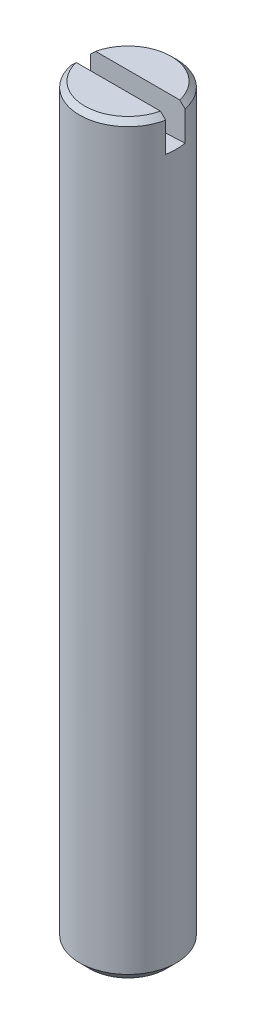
ISO-10303-21;
HEADER;
FILE_DESCRIPTION(('STEP AP214'),'2;1');
FILE_NAME('part.step','',(''),(''),'','','');
FILE_SCHEMA(('AUTOMOTIVE_DESIGN { 1 0 10303 214 1 1 1 1 }'));
ENDSEC;
DATA;
#1=APPLICATION_CONTEXT('core data for automotive mechanical design processes');
#2=APPLICATION_PROTOCOL_DEFINITION('international standard','automotive_design',2000,#1);
#3=PRODUCT_CONTEXT('',#1,'mechanical');
#4=PRODUCT('Part','Part','',(#3));
#5=PRODUCT_RELATED_PRODUCT_CATEGORY('part','',(#4));
#6=PRODUCT_DEFINITION_FORMATION('','',#4);
#7=PRODUCT_DEFINITION_CONTEXT('part definition',#1,'design');
#8=PRODUCT_DEFINITION('design','',#6,#7);
#9=PRODUCT_DEFINITION_SHAPE('','',#8);
#10=(LENGTH_UNIT() NAMED_UNIT(*) SI_UNIT(.MILLI.,.METRE.));
#11=(NAMED_UNIT(*) PLANE_ANGLE_UNIT() SI_UNIT($,.RADIAN.));
#12=(NAMED_UNIT(*) SI_UNIT($,.STERADIAN.) SOLID_ANGLE_UNIT());
#13=UNCERTAINTY_MEASURE_WITH_UNIT(LENGTH_MEASURE(1.E-05),#10,'distance_accuracy_value','');
#14=(GEOMETRIC_REPRESENTATION_CONTEXT(3) GLOBAL_UNCERTAINTY_ASSIGNED_CONTEXT((#13)) GLOBAL_UNIT_ASSIGNED_CONTEXT((#10,
#11,#12)) REPRESENTATION_CONTEXT('',''));
#15=CARTESIAN_POINT('',(0.,0.,0.));
#16=DIRECTION('',(0.,0.,1.));
#17=DIRECTION('',(1.,0.,0.));
#18=AXIS2_PLACEMENT_3D('',#15,#16,#17);
#19=CARTESIAN_POINT('',(0.,61.,0.4));
#20=DIRECTION('',(0.,0.,-1.));
#21=DIRECTION('',(-1.,0.,0.));
#22=AXIS2_PLACEMENT_3D('',#19,#20,#21);
#23=CYLINDRICAL_SURFACE('',#22,31.5);
#24=CARTESIAN_POINT('',(1.95959179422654,29.5610114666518,-0.4));
#25=CARTESIAN_POINT('',(1.97091486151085,29.5617184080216,-0.344561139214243));
#26=CARTESIAN_POINT('',(1.97987306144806,29.562281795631,-0.288637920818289));
#27=CARTESIAN_POINT('',(1.99302430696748,29.5631121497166,-0.1762131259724));
#28=CARTESIAN_POINT('',(1.99721579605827,29.5633790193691,-0.119711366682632));
#29=CARTESIAN_POINT('',(2.0007609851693,29.5636046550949,-0.00749894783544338));
#30=CARTESIAN_POINT('',(2.00019410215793,29.5635684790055,0.0482092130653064));
#31=CARTESIAN_POINT('',(1.99441663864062,29.5632012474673,0.15936012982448));
#32=CARTESIAN_POINT('',(1.98920814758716,29.5628703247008,0.21480299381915));
#33=CARTESIAN_POINT('',(1.97576492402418,29.562023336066,0.313516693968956));
#34=CARTESIAN_POINT('',(1.96839158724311,29.561560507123,0.356906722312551));
#35=CARTESIAN_POINT('',(1.95959179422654,29.5610114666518,0.4));
#36=B_SPLINE_CURVE_WITH_KNOTS('',3,(#24,#25,#26,#27,#28,#29,#30,#31,#32,#33,#34,#35),
.UNSPECIFIED.,.F.,.F.,(4,2,2,2,2,4),(0.,0.169712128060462,0.33947965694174,0.506419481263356,
0.673284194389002,0.805229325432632),.UNSPECIFIED.);
#37=CARTESIAN_POINT('',(1.95959179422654,29.5610114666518,-0.4));
#38=VERTEX_POINT('',#37);
#39=CARTESIAN_POINT('',(1.95959179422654,29.5610114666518,0.4));
#40=VERTEX_POINT('',#39);
#41=EDGE_CURVE('E81',#38,#40,#36,.T.);
#42=ORIENTED_EDGE('',*,*,#41,.F.);
#43=CARTESIAN_POINT('',(0.,61.,-0.4));
#44=DIRECTION('',(0.,0.,-1.));
#45=DIRECTION('',(-1.,0.,0.));
#46=AXIS2_PLACEMENT_3D('',#43,#44,#45);
#47=CIRCLE('',#46,31.5);
#48=CARTESIAN_POINT('',(-1.95959179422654,29.5610114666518,-0.4));
#49=VERTEX_POINT('',#48);
#50=EDGE_CURVE('E87',#49,#38,#47,.F.);
#51=ORIENTED_EDGE('',*,*,#50,.F.);
#52=CARTESIAN_POINT('',(-1.95959179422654,29.5610114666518,0.4));
#53=CARTESIAN_POINT('',(-1.97091486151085,29.5617184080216,0.344561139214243));
#54=CARTESIAN_POINT('',(-1.97987306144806,29.562281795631,0.288637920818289));
#55=CARTESIAN_POINT('',(-1.99302430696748,29.5631121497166,0.176213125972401));
#56=CARTESIAN_POINT('',(-1.99721579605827,29.5633790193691,0.119711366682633));
#57=CARTESIAN_POINT('',(-2.0007609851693,29.5636046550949,0.00749894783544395));
#58=CARTESIAN_POINT('',(-2.00019410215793,29.5635684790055,-0.0482092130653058));
#59=CARTESIAN_POINT('',(-1.99441663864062,29.5632012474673,-0.159360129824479));
#60=CARTESIAN_POINT('',(-1.98920814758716,29.5628703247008,-0.214802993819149));
#61=CARTESIAN_POINT('',(-1.97576492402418,29.562023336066,-0.313516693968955));
#62=CARTESIAN_POINT('',(-1.96839158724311,29.561560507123,-0.356906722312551));
#63=CARTESIAN_POINT('',(-1.95959179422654,29.5610114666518,-0.4));
#64=B_SPLINE_CURVE_WITH_KNOTS('',3,(#52,#53,#54,#55,#56,#57,#58,#59,#60,#61,#62,#63),
.UNSPECIFIED.,.F.,.F.,(4,2,2,2,2,4),(0.,0.169712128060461,0.33947965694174,0.506419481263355,
0.673284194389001,0.805229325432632),.UNSPECIFIED.);
#65=CARTESIAN_POINT('',(-1.95959179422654,29.5610114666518,0.4));
#66=VERTEX_POINT('',#65);
#67=EDGE_CURVE('E18',#66,#49,#64,.T.);
#68=ORIENTED_EDGE('',*,*,#67,.F.);
#69=CARTESIAN_POINT('',(0.,61.,0.4));
#70=DIRECTION('',(0.,0.,-1.));
#71=DIRECTION('',(-1.,0.,0.));
#72=AXIS2_PLACEMENT_3D('',#69,#70,#71);
#73=CIRCLE('',#72,31.5);
#74=EDGE_CURVE('E80',#66,#40,#73,.F.);
#75=ORIENTED_EDGE('',*,*,#74,.T.);
#76=EDGE_LOOP('',(#42,#51,#68,#75));
#77=FACE_BOUND('',#76,.T.);
#78=ADVANCED_FACE('F14',(#77),#23,.F.);
#79=CARTESIAN_POINT('',(0.,61.,0.4));
#80=DIRECTION('',(0.,0.,1.));
#81=DIRECTION('',(1.,0.,0.));
#82=AXIS2_PLACEMENT_3D('',#79,#80,#81);
#83=PLANE('',#82);
#84=DIRECTION('',(1.,0.,0.));
#85=VECTOR('',#84,1.);
#86=CARTESIAN_POINT('',(0.,31.,0.4));
#87=LINE('',#86,#85);
#88=CARTESIAN_POINT('',(-1.74011788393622,31.0000000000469,0.4));
#89=VERTEX_POINT('',#88);
#90=CARTESIAN_POINT('',(1.74011788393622,31.0000000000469,0.4));
#91=VERTEX_POINT('',#90);
#92=EDGE_CURVE('E156',#89,#91,#87,.T.);
#93=ORIENTED_EDGE('',*,*,#92,.T.);
#94=CARTESIAN_POINT('',(1.95959179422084,30.7854999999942,0.4));
#95=CARTESIAN_POINT('',(1.9230603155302,30.8212986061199,0.4));
#96=CARTESIAN_POINT('',(1.88650508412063,30.8570729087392,0.4));
#97=CARTESIAN_POINT('',(1.81334711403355,30.928572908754,0.4));
#98=CARTESIAN_POINT('',(1.77674437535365,30.9642986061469,0.4));
#99=CARTESIAN_POINT('',(1.74011788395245,31.0000000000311,0.4));
#100=B_SPLINE_CURVE_WITH_KNOTS('',3,(#94,#95,#96,#97,#98,#99),.UNSPECIFIED.,.F.,.F.,(4,2,4),(0.,
0.153443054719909,0.306886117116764),.UNSPECIFIED.);
#101=CARTESIAN_POINT('',(1.95959179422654,30.7854999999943,0.4));
#102=VERTEX_POINT('',#101);
#103=EDGE_CURVE('E94',#102,#91,#100,.T.);
#104=ORIENTED_EDGE('',*,*,#103,.F.);
#105=DIRECTION('',(0.,1.,0.));
#106=VECTOR('',#105,1.);
#107=CARTESIAN_POINT('',(1.95959179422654,61.,0.4));
#108=LINE('',#107,#106);
#109=EDGE_CURVE('E92',#40,#102,#108,.T.);
#110=ORIENTED_EDGE('',*,*,#109,.F.);
#111=ORIENTED_EDGE('',*,*,#74,.F.);
#112=DIRECTION('',(0.,1.,0.));
#113=VECTOR('',#112,1.);
#114=CARTESIAN_POINT('',(-1.95959179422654,61.,0.4));
#115=LINE('',#114,#113);
#116=CARTESIAN_POINT('',(-1.95959179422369,30.7854999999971,0.4));
#117=VERTEX_POINT('',#116);
#118=EDGE_CURVE('E72',#117,#66,#115,.F.);
#119=ORIENTED_EDGE('',*,*,#118,.F.);
#120=CARTESIAN_POINT('',(-1.74011788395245,31.0000000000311,0.4));
#121=CARTESIAN_POINT('',(-1.77674437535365,30.9642986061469,0.4));
#122=CARTESIAN_POINT('',(-1.81334711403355,30.928572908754,0.4));
#123=CARTESIAN_POINT('',(-1.88650508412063,30.8570729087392,0.4));
#124=CARTESIAN_POINT('',(-1.9230603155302,30.8212986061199,0.4));
#125=CARTESIAN_POINT('',(-1.95959179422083,30.7854999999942,0.4));
#126=B_SPLINE_CURVE_WITH_KNOTS('',3,(#120,#121,#122,#123,#124,#125),.UNSPECIFIED.,.F.,.F.,(4,2,
4),(0.,0.153443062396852,0.306886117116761),.UNSPECIFIED.);
#127=EDGE_CURVE('E144',#89,#117,#126,.T.);
#128=ORIENTED_EDGE('',*,*,#127,.F.);
#129=EDGE_LOOP('',(#93,#104,#110,#111,#119,#128));
#130=FACE_BOUND('',#129,.T.);
#131=ADVANCED_FACE('F90',(#130),#83,.F.);
#132=CARTESIAN_POINT('',(0.,61.,-0.4));
#133=DIRECTION('',(0.,0.,1.));
#134=DIRECTION('',(1.,0.,0.));
#135=AXIS2_PLACEMENT_3D('',#132,#133,#134);
#136=PLANE('',#135);
#137=DIRECTION('',(1.,0.,0.));
#138=VECTOR('',#137,1.);
#139=CARTESIAN_POINT('',(0.,31.,-0.4));
#140=LINE('',#139,#138);
#141=CARTESIAN_POINT('',(1.74011788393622,31.0000000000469,-0.4));
#142=VERTEX_POINT('',#141);
#143=CARTESIAN_POINT('',(-1.74011788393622,31.0000000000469,-0.4));
#144=VERTEX_POINT('',#143);
#145=EDGE_CURVE('E158',#142,#144,#140,.F.);
#146=ORIENTED_EDGE('',*,*,#145,.T.);
#147=CARTESIAN_POINT('',(-1.74011788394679,31.0000000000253,-0.399999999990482));
#148=CARTESIAN_POINT('',(-1.77674437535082,30.964298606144,-0.399999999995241));
#149=CARTESIAN_POINT('',(-1.8133471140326,30.928572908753,-0.399999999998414));
#150=CARTESIAN_POINT('',(-1.88650508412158,30.8570729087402,-0.400000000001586));
#151=CARTESIAN_POINT('',(-1.92306031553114,30.8212986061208,-0.400000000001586));
#152=CARTESIAN_POINT('',(-1.95959179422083,30.7854999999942,-0.4));
#153=B_SPLINE_CURVE_WITH_KNOTS('',3,(#147,#148,#149,#150,#151,#152),.UNSPECIFIED.,.F.,.F.,(4,2,
4),(0.,0.153443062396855,0.306886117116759),.UNSPECIFIED.);
#154=CARTESIAN_POINT('',(-1.95959179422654,30.7854999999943,-0.4));
#155=VERTEX_POINT('',#154);
#156=EDGE_CURVE('E38',#144,#155,#153,.T.);
#157=ORIENTED_EDGE('',*,*,#156,.T.);
#158=DIRECTION('',(0.,1.,0.));
#159=VECTOR('',#158,1.);
#160=CARTESIAN_POINT('',(-1.95959179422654,61.,-0.4));
#161=LINE('',#160,#159);
#162=EDGE_CURVE('E149',#155,#49,#161,.F.);
#163=ORIENTED_EDGE('',*,*,#162,.T.);
#164=ORIENTED_EDGE('',*,*,#50,.T.);
#165=DIRECTION('',(0.,1.,0.));
#166=VECTOR('',#165,1.);
#167=CARTESIAN_POINT('',(1.95959179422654,61.,-0.4));
#168=LINE('',#167,#166);
#169=CARTESIAN_POINT('',(1.95959179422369,30.7854999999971,-0.4));
#170=VERTEX_POINT('',#169);
#171=EDGE_CURVE('E132',#38,#170,#168,.T.);
#172=ORIENTED_EDGE('',*,*,#171,.T.);
#173=CARTESIAN_POINT('',(1.95959179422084,30.7854999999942,-0.4));
#174=CARTESIAN_POINT('',(1.9230603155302,30.8212986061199,-0.4));
#175=CARTESIAN_POINT('',(1.88650508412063,30.8570729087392,-0.4));
#176=CARTESIAN_POINT('',(1.81334711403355,30.9285729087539,-0.4));
#177=CARTESIAN_POINT('',(1.77674437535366,30.9642986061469,-0.4));
#178=CARTESIAN_POINT('',(1.74011788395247,31.0000000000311,-0.4));
#179=B_SPLINE_CURVE_WITH_KNOTS('',3,(#173,#174,#175,#176,#177,#178),.UNSPECIFIED.,.F.,.F.,(4,2,
4),(0.,0.153443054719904,0.306886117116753),.UNSPECIFIED.);
#180=EDGE_CURVE('E126',#170,#142,#179,.T.);
#181=ORIENTED_EDGE('',*,*,#180,.T.);
#182=EDGE_LOOP('',(#146,#157,#163,#164,#172,#181));
#183=FACE_BOUND('',#182,.T.);
#184=ADVANCED_FACE('F133',(#183),#136,.T.);
#185=CARTESIAN_POINT('',(1.5705,0.,0.));
#186=DIRECTION('',(0.,1.,0.));
#187=DIRECTION('',(0.,0.,1.));
#188=AXIS2_PLACEMENT_3D('',#185,#186,#187);
#189=PLANE('',#188);
#190=CARTESIAN_POINT('',(0.,-5.6843418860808E-11,0.));
#191=DIRECTION('',(0.,1.,0.));
#192=DIRECTION('',(-1.,0.,0.));
#193=AXIS2_PLACEMENT_3D('',#190,#191,#192);
#194=CIRCLE('',#193,1.57050000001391);
#195=CARTESIAN_POINT('',(-1.57050000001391,-5.68433975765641E-11,0.));
#196=VERTEX_POINT('',#195);
#197=EDGE_CURVE('E162',#196,#196,#194,.T.);
#198=ORIENTED_EDGE('',*,*,#197,.F.);
#199=EDGE_LOOP('',(#198));
#200=FACE_BOUND('',#199,.T.);
#201=ADVANCED_FACE('F137',(#200),#189,.F.);
#202=CARTESIAN_POINT('',(0.,31.,0.));
#203=DIRECTION('',(0.,-1.,0.));
#204=DIRECTION('',(0.,0.,-1.));
#205=AXIS2_PLACEMENT_3D('',#202,#203,#204);
#206=PLANE('',#205);
#207=ORIENTED_EDGE('',*,*,#92,.F.);
#208=CARTESIAN_POINT('',(0.,31.0000000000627,0.));
#209=DIRECTION('',(0.,-1.,0.));
#210=DIRECTION('',(0.,0.,-1.));
#211=AXIS2_PLACEMENT_3D('',#208,#209,#210);
#212=CIRCLE('',#211,1.78549999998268);
#213=EDGE_CURVE('E154',#91,#89,#212,.T.);
#214=ORIENTED_EDGE('',*,*,#213,.F.);
#215=EDGE_LOOP('',(#207,#214));
#216=FACE_BOUND('',#215,.T.);
#217=ADVANCED_FACE('F160',(#216),#206,.F.);
#218=CARTESIAN_POINT('',(0.,31.,0.));
#219=DIRECTION('',(0.,-1.,0.));
#220=DIRECTION('',(0.,0.,-1.));
#221=AXIS2_PLACEMENT_3D('',#218,#219,#220);
#222=PLANE('',#221);
#223=CARTESIAN_POINT('',(0.,31.0000000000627,0.));
#224=DIRECTION('',(0.,-1.,0.));
#225=DIRECTION('',(0.,0.,-1.));
#226=AXIS2_PLACEMENT_3D('',#223,#224,#225);
#227=CIRCLE('',#226,1.78549999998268);
#228=EDGE_CURVE('E161',#144,#142,#227,.T.);
#229=ORIENTED_EDGE('',*,*,#228,.F.);
#230=ORIENTED_EDGE('',*,*,#145,.F.);
#231=EDGE_LOOP('',(#229,#230));
#232=FACE_BOUND('',#231,.T.);
#233=ADVANCED_FACE('F182',(#232),#222,.F.);
#234=CARTESIAN_POINT('',(0.,0.429499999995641,0.));
#235=DIRECTION('',(0.,1.,0.));
#236=DIRECTION('',(-1.,0.,0.));
#237=AXIS2_PLACEMENT_3D('',#234,#235,#236);
#238=CONICAL_SURFACE('',#237,2.00000000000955,0.785398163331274);
#239=CARTESIAN_POINT('',(0.,0.4295,0.));
#240=DIRECTION('',(0.,-1.,0.));
#241=DIRECTION('',(0.,0.,-1.));
#242=AXIS2_PLACEMENT_3D('',#239,#240,#241);
#243=CIRCLE('',#242,2.);
#244=CARTESIAN_POINT('',(0.,0.4295,-2.));
#245=VERTEX_POINT('',#244);
#246=EDGE_CURVE('E164',#245,#245,#243,.F.);
#247=ORIENTED_EDGE('',*,*,#246,.F.);
#248=EDGE_LOOP('',(#247));
#249=FACE_BOUND('',#248,.T.);
#250=ORIENTED_EDGE('',*,*,#197,.T.);
#251=EDGE_LOOP('',(#250));
#252=FACE_BOUND('',#251,.T.);
#253=ADVANCED_FACE('F179',(#249,#252),#238,.T.);
#254=CARTESIAN_POINT('',(0.,30.7855000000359,0.));
#255=DIRECTION('',(0.,-1.,0.));
#256=DIRECTION('',(0.,0.,-1.));
#257=AXIS2_PLACEMENT_3D('',#254,#255,#256);
#258=CONICAL_SURFACE('',#257,1.9999999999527,0.785398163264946);
#259=ORIENTED_EDGE('',*,*,#213,.T.);
#260=ORIENTED_EDGE('',*,*,#127,.T.);
#261=CARTESIAN_POINT('',(0.,30.7855,0.));
#262=DIRECTION('',(0.,-1.,0.));
#263=DIRECTION('',(0.,0.,-1.));
#264=AXIS2_PLACEMENT_3D('',#261,#262,#263);
#265=CIRCLE('',#264,2.);
#266=EDGE_CURVE('E29',#102,#117,#265,.T.);
#267=ORIENTED_EDGE('',*,*,#266,.F.);
#268=ORIENTED_EDGE('',*,*,#103,.T.);
#269=EDGE_LOOP('',(#259,#260,#267,#268));
#270=FACE_BOUND('',#269,.T.);
#271=ADVANCED_FACE('F114',(#270),#258,.T.);
#272=CARTESIAN_POINT('',(0.,30.7855000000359,0.));
#273=DIRECTION('',(0.,-1.,0.));
#274=DIRECTION('',(0.,0.,-1.));
#275=AXIS2_PLACEMENT_3D('',#272,#273,#274);
#276=CONICAL_SURFACE('',#275,1.9999999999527,0.785398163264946);
#277=ORIENTED_EDGE('',*,*,#156,.F.);
#278=ORIENTED_EDGE('',*,*,#228,.T.);
#279=ORIENTED_EDGE('',*,*,#180,.F.);
#280=CARTESIAN_POINT('',(0.,30.7855,0.));
#281=DIRECTION('',(0.,-1.,0.));
#282=DIRECTION('',(0.,0.,-1.));
#283=AXIS2_PLACEMENT_3D('',#280,#281,#282);
#284=CIRCLE('',#283,2.);
#285=EDGE_CURVE('E9',#155,#170,#284,.T.);
#286=ORIENTED_EDGE('',*,*,#285,.F.);
#287=EDGE_LOOP('',(#277,#278,#279,#286));
#288=FACE_BOUND('',#287,.T.);
#289=ADVANCED_FACE('F110',(#288),#276,.T.);
#290=CARTESIAN_POINT('',(0.,21.5,0.));
#291=DIRECTION('',(0.,-1.,0.));
#292=DIRECTION('',(0.,0.,-1.));
#293=AXIS2_PLACEMENT_3D('',#290,#291,#292);
#294=CYLINDRICAL_SURFACE('',#293,2.);
#295=ORIENTED_EDGE('',*,*,#41,.T.);
#296=ORIENTED_EDGE('',*,*,#109,.T.);
#297=ORIENTED_EDGE('',*,*,#266,.T.);
#298=ORIENTED_EDGE('',*,*,#118,.T.);
#299=ORIENTED_EDGE('',*,*,#67,.T.);
#300=ORIENTED_EDGE('',*,*,#162,.F.);
#301=ORIENTED_EDGE('',*,*,#285,.T.);
#302=ORIENTED_EDGE('',*,*,#171,.F.);
#303=EDGE_LOOP('',(#295,#296,#297,#298,#299,#300,#301,#302));
#304=FACE_BOUND('',#303,.T.);
#305=ORIENTED_EDGE('',*,*,#246,.T.);
#306=EDGE_LOOP('',(#305));
#307=FACE_BOUND('',#306,.T.);
#308=ADVANCED_FACE('F74',(#304,#307),#294,.T.);
#309=CLOSED_SHELL('',(#78,#131,#184,#201,#217,#233,#253,#271,#289,#308));
#310=MANIFOLD_SOLID_BREP('B1',#309);
#311=ADVANCED_BREP_SHAPE_REPRESENTATION('',(#18,#310),#14);
#312=SHAPE_DEFINITION_REPRESENTATION(#9,#311);
ENDSEC;
END-ISO-10303-21;
